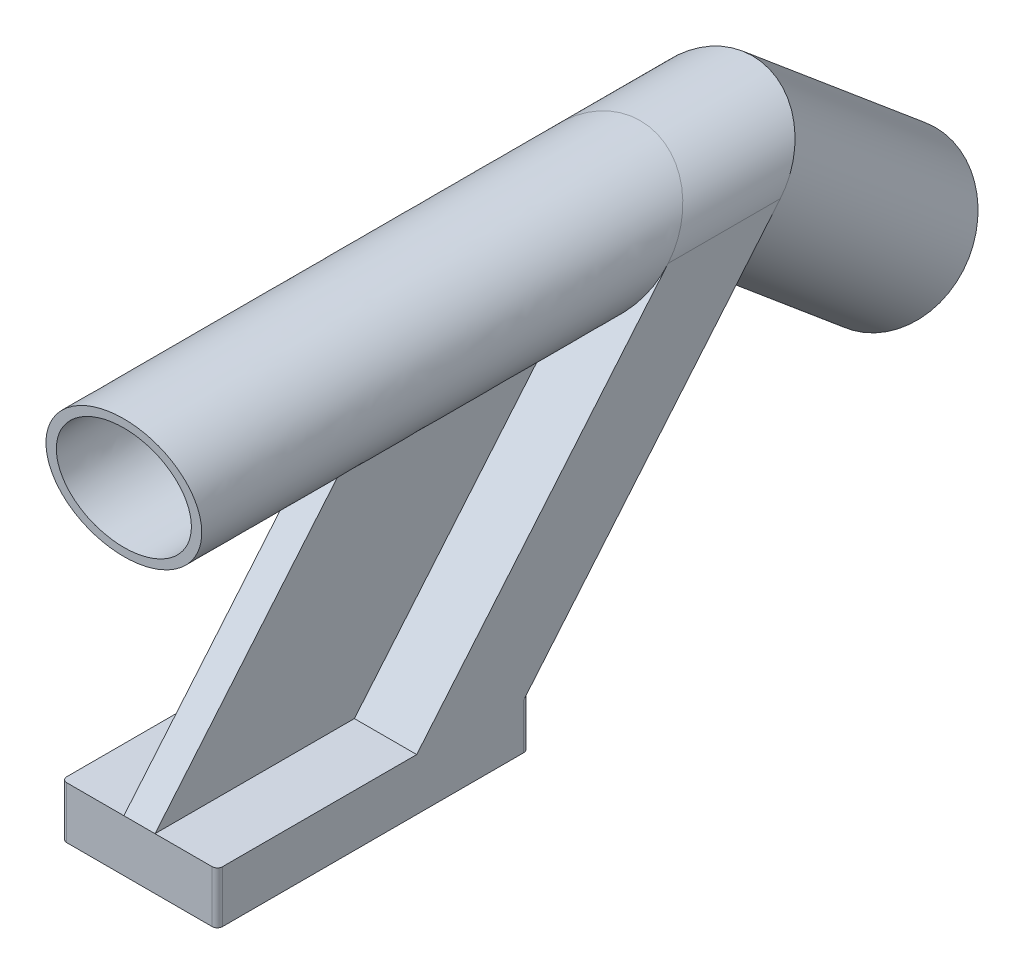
ISO-10303-21;
HEADER;
FILE_DESCRIPTION(('STEP AP214'),'2;1');
FILE_NAME('part.step','',(''),(''),'','','');
FILE_SCHEMA(('AUTOMOTIVE_DESIGN { 1 0 10303 214 1 1 1 1 }'));
ENDSEC;
DATA;
#1=APPLICATION_CONTEXT('core data for automotive mechanical design processes');
#2=APPLICATION_PROTOCOL_DEFINITION('international standard','automotive_design',2000,#1);
#3=PRODUCT_CONTEXT('',#1,'mechanical');
#4=PRODUCT('Part','Part','',(#3));
#5=PRODUCT_RELATED_PRODUCT_CATEGORY('part','',(#4));
#6=PRODUCT_DEFINITION_FORMATION('','',#4);
#7=PRODUCT_DEFINITION_CONTEXT('part definition',#1,'design');
#8=PRODUCT_DEFINITION('design','',#6,#7);
#9=PRODUCT_DEFINITION_SHAPE('','',#8);
#10=(LENGTH_UNIT() NAMED_UNIT(*) SI_UNIT(.MILLI.,.METRE.));
#11=(NAMED_UNIT(*) PLANE_ANGLE_UNIT() SI_UNIT($,.RADIAN.));
#12=(NAMED_UNIT(*) SI_UNIT($,.STERADIAN.) SOLID_ANGLE_UNIT());
#13=UNCERTAINTY_MEASURE_WITH_UNIT(LENGTH_MEASURE(1.E-05),#10,'distance_accuracy_value','');
#14=(GEOMETRIC_REPRESENTATION_CONTEXT(3) GLOBAL_UNCERTAINTY_ASSIGNED_CONTEXT((#13)) GLOBAL_UNIT_ASSIGNED_CONTEXT((#10,
#11,#12)) REPRESENTATION_CONTEXT('',''));
#15=CARTESIAN_POINT('',(0.,0.,0.));
#16=DIRECTION('',(0.,0.,1.));
#17=DIRECTION('',(1.,0.,0.));
#18=AXIS2_PLACEMENT_3D('',#15,#16,#17);
#19=CARTESIAN_POINT('',(0.,338.502844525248,215.962388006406));
#20=DIRECTION('',(0.,0.642787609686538,0.766044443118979));
#21=DIRECTION('',(0.,-0.766044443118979,0.642787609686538));
#22=AXIS2_PLACEMENT_3D('',#19,#20,#21);
#23=CIRCLE('',#22,75.);
#24=DIRECTION('',(0.,0.,-1.));
#25=VECTOR('',#24,1.);
#26=SURFACE_OF_LINEAR_EXTRUSION('',#23,#25);
#27=CARTESIAN_POINT('',(0.,338.502844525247,-284.037611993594));
#28=DIRECTION('',(0.,0.642787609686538,0.766044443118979));
#29=DIRECTION('',(0.,0.766044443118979,-0.642787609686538));
#30=AXIS2_PLACEMENT_3D('',#27,#28,#29);
#31=CIRCLE('',#30,75.);
#32=CARTESIAN_POINT('',(75.,338.502844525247,-284.037611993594));
#33=VERTEX_POINT('',#32);
#34=CARTESIAN_POINT('',(-75.,338.502844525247,-284.037611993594));
#35=VERTEX_POINT('',#34);
#36=EDGE_CURVE('E156',#33,#35,#31,.T.);
#37=ORIENTED_EDGE('',*,*,#36,.T.);
#38=CARTESIAN_POINT('',(0.,338.502844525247,-284.037611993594));
#39=DIRECTION('',(0.,0.642787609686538,0.766044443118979));
#40=DIRECTION('',(0.,-0.766044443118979,0.642787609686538));
#41=AXIS2_PLACEMENT_3D('',#38,#39,#40);
#42=CIRCLE('',#41,75.);
#43=CARTESIAN_POINT('',(-15.,282.210304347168,-236.802562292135));
#44=VERTEX_POINT('',#43);
#45=EDGE_CURVE('E149',#35,#44,#42,.T.);
#46=ORIENTED_EDGE('',*,*,#45,.T.);
#47=DIRECTION('',(0.,0.,-1.));
#48=VECTOR('',#47,1.);
#49=CARTESIAN_POINT('',(-15.,282.210304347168,263.197437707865));
#50=LINE('',#49,#48);
#51=CARTESIAN_POINT('',(-15.,282.210304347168,-44.8475807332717));
#52=VERTEX_POINT('',#51);
#53=EDGE_CURVE('E153',#52,#44,#50,.T.);
#54=ORIENTED_EDGE('',*,*,#53,.F.);
#55=CARTESIAN_POINT('',(-15.,282.210304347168,-44.8475807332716));
#56=CARTESIAN_POINT('',(-14.0982598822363,282.069294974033,-44.7292598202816));
#57=CARTESIAN_POINT('',(-13.1931334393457,281.941012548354,-44.6216180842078));
#58=CARTESIAN_POINT('',(-11.3773106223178,281.710045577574,-44.4278137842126));
#59=CARTESIAN_POINT('',(-10.4666141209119,281.607361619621,-44.3416517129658));
#60=CARTESIAN_POINT('',(-8.64111164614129,281.427763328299,-44.1909508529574));
#61=CARTESIAN_POINT('',(-7.72630669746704,281.350842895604,-44.1264069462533));
#62=CARTESIAN_POINT('',(-5.89368052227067,281.222841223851,-44.0190007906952));
#63=CARTESIAN_POINT('',(-4.97585937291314,281.171759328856,-43.9761379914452));
#64=CARTESIAN_POINT('',(-2.4757861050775,281.068014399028,-43.88908565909));
#65=CARTESIAN_POINT('',(-0.89160533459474,281.040766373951,-43.8662218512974));
#66=CARTESIAN_POINT('',(2.27561874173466,281.063147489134,-43.8850018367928));
#67=CARTESIAN_POINT('',(3.85866209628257,281.11277311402,-43.9266426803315));
#68=CARTESIAN_POINT('',(7.04367020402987,281.290158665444,-44.0754868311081));
#69=CARTESIAN_POINT('',(8.64551670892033,281.41919307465,-44.1837595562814));
#70=CARTESIAN_POINT('',(11.0375041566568,281.671732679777,-44.3956654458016));
#71=CARTESIAN_POINT('',(11.8331279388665,281.765758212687,-44.4745622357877));
#72=CARTESIAN_POINT('',(13.4200125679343,281.973378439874,-44.6487762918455));
#73=CARTESIAN_POINT('',(14.2112734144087,282.086973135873,-44.7440935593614));
#74=CARTESIAN_POINT('',(15.,282.210304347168,-44.8475807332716));
#75=B_SPLINE_CURVE_WITH_KNOTS('',3,(#55,#56,#57,#58,#59,#60,#61,#62,#63,#64,#65,#66,#67,#68,#69,
#70,#71,#72,#73,#74),.UNSPECIFIED.,.F.,.F.,(4,2,2,2,2,2,2,2,2,4),(0.,2.76084314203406,
5.52174960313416,8.28200197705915,11.0421842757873,15.7924790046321,20.5425565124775,
25.370934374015,27.7856837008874,30.2004332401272),.UNSPECIFIED.);
#76=CARTESIAN_POINT('',(15.,282.210304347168,-44.8475807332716));
#77=VERTEX_POINT('',#76);
#78=EDGE_CURVE('E186',#52,#77,#75,.T.);
#79=ORIENTED_EDGE('',*,*,#78,.T.);
#80=DIRECTION('',(0.,0.,-1.));
#81=VECTOR('',#80,1.);
#82=CARTESIAN_POINT('',(15.,282.210304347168,263.197437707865));
#83=LINE('',#82,#81);
#84=CARTESIAN_POINT('',(15.,282.210304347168,-236.802562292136));
#85=VERTEX_POINT('',#84);
#86=EDGE_CURVE('E184',#77,#85,#83,.T.);
#87=ORIENTED_EDGE('',*,*,#86,.T.);
#88=EDGE_CURVE('E161',#85,#33,#42,.T.);
#89=ORIENTED_EDGE('',*,*,#88,.T.);
#90=EDGE_LOOP('',(#37,#46,#54,#79,#87,#89));
#91=FACE_BOUND('',#90,.T.);
#92=CARTESIAN_POINT('',(0.,281.049511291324,165.));
#93=CARTESIAN_POINT('',(2.66369961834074,281.049503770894,165.));
#94=CARTESIAN_POINT('',(5.32727945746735,281.158140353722,165.));
#95=CARTESIAN_POINT('',(10.6376405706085,281.593563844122,165.));
#96=CARTESIAN_POINT('',(13.2844158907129,281.920424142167,165.));
#97=CARTESIAN_POINT('',(18.4183866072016,282.774297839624,165.));
#98=CARTESIAN_POINT('',(20.9072573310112,283.291238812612,165.));
#99=CARTESIAN_POINT('',(25.8336466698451,284.528827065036,165.));
#100=CARTESIAN_POINT('',(28.2711757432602,285.249432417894,165.));
#101=CARTESIAN_POINT('',(32.8406712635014,286.818210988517,165.));
#102=CARTESIAN_POINT('',(34.9792596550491,287.647098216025,165.));
#103=CARTESIAN_POINT('',(39.1813985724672,289.478037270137,165.));
#104=CARTESIAN_POINT('',(41.2449512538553,290.480084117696,165.));
#105=CARTESIAN_POINT('',(45.0371748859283,292.531356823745,165.));
#106=CARTESIAN_POINT('',(46.7765150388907,293.560852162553,165.));
#107=CARTESIAN_POINT('',(50.1642726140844,295.758731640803,165.));
#108=CARTESIAN_POINT('',(51.8127368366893,296.92704329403,165.));
#109=CARTESIAN_POINT('',(54.8031492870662,299.250492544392,165.));
#110=CARTESIAN_POINT('',(56.1577523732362,300.389282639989,165.));
#111=CARTESIAN_POINT('',(58.1167366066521,302.178446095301,165.));
#112=CARTESIAN_POINT('',(58.7579822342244,302.788765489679,165.));
#113=CARTESIAN_POINT('',(60.0140934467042,304.036239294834,165.));
#114=CARTESIAN_POINT('',(60.6289535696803,304.673399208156,165.));
#115=CARTESIAN_POINT('',(62.307287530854,306.490947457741,165.));
#116=CARTESIAN_POINT('',(63.3391667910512,307.700825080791,165.));
#117=CARTESIAN_POINT('',(65.2984733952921,310.203368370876,165.));
#118=CARTESIAN_POINT('',(66.2258703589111,311.496057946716,165.));
#119=CARTESIAN_POINT('',(67.5279112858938,313.492634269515,165.));
#120=CARTESIAN_POINT('',(67.9470963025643,314.167775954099,165.));
#121=CARTESIAN_POINT('',(68.7541509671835,315.536489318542,165.));
#122=CARTESIAN_POINT('',(69.1420242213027,316.230058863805,165.));
#123=CARTESIAN_POINT('',(69.8846950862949,317.634530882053,165.));
#124=CARTESIAN_POINT('',(70.2394990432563,318.345429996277,165.));
#125=CARTESIAN_POINT('',(70.9144175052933,319.783433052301,165.));
#126=CARTESIAN_POINT('',(71.234533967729,320.510536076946,165.));
#127=CARTESIAN_POINT('',(72.0216842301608,322.42531636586,165.));
#128=CARTESIAN_POINT('',(72.4600931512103,323.624911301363,165.));
#129=CARTESIAN_POINT('',(73.2370456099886,326.056027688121,165.));
#130=CARTESIAN_POINT('',(73.5756006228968,327.287545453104,165.));
#131=CARTESIAN_POINT('',(74.004633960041,329.152282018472,165.));
#132=CARTESIAN_POINT('',(74.1344953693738,329.776655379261,165.));
#133=CARTESIAN_POINT('',(74.3675297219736,331.030344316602,165.));
#134=CARTESIAN_POINT('',(74.4707051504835,331.659659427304,165.));
#135=CARTESIAN_POINT('',(74.6499556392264,332.92220272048,165.));
#136=CARTESIAN_POINT('',(74.7260278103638,333.555431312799,165.));
#137=CARTESIAN_POINT('',(74.8507433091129,334.824531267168,165.));
#138=CARTESIAN_POINT('',(74.8993884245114,335.460402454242,165.));
#139=CARTESIAN_POINT('',(74.9807412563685,336.947453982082,165.));
#140=CARTESIAN_POINT('',(75.0026157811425,337.799250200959,165.));
#141=CARTESIAN_POINT('',(74.996885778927,339.502663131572,165.));
#142=CARTESIAN_POINT('',(74.9692804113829,340.354279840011,165.));
#143=CARTESIAN_POINT('',(74.8648025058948,342.054472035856,165.));
#144=CARTESIAN_POINT('',(74.7879309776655,342.90304758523,165.));
#145=CARTESIAN_POINT('',(74.5854786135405,344.594500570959,165.));
#146=CARTESIAN_POINT('',(74.4598895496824,345.437377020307,165.));
#147=CARTESIAN_POINT('',(74.160912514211,347.114620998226,165.));
#148=CARTESIAN_POINT('',(73.9875239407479,347.948988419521,165.));
#149=CARTESIAN_POINT('',(73.5942049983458,349.606594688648,165.));
#150=CARTESIAN_POINT('',(73.3742759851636,350.42983385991,165.));
#151=CARTESIAN_POINT('',(72.7756579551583,352.445690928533,165.));
#152=CARTESIAN_POINT('',(72.370865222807,353.630645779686,165.));
#153=CARTESIAN_POINT('',(71.469623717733,355.964934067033,165.));
#154=CARTESIAN_POINT('',(70.9731765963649,357.114268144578,165.));
#155=CARTESIAN_POINT('',(69.8947187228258,359.372344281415,165.));
#156=CARTESIAN_POINT('',(69.3126869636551,360.481076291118,165.));
#157=CARTESIAN_POINT('',(68.0697689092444,362.653343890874,165.));
#158=CARTESIAN_POINT('',(67.4088789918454,363.716877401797,165.));
#159=CARTESIAN_POINT('',(65.9382700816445,365.909797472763,165.));
#160=CARTESIAN_POINT('',(65.1201768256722,367.033567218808,165.));
#161=CARTESIAN_POINT('',(63.4040266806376,369.218264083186,165.));
#162=CARTESIAN_POINT('',(62.5059617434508,370.279184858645,165.));
#163=CARTESIAN_POINT('',(60.6386466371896,372.335898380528,165.));
#164=CARTESIAN_POINT('',(59.6694092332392,373.331702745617,165.));
#165=CARTESIAN_POINT('',(57.6673392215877,375.257498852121,165.));
#166=CARTESIAN_POINT('',(56.6344941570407,376.187477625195,165.));
#167=CARTESIAN_POINT('',(54.7874400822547,377.748755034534,165.));
#168=CARTESIAN_POINT('',(53.9858387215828,378.395056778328,165.));
#169=CARTESIAN_POINT('',(52.3547297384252,379.651051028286,165.));
#170=CARTESIAN_POINT('',(51.5252267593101,380.260749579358,165.));
#171=CARTESIAN_POINT('',(48.9994097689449,382.034619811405,165.));
#172=CARTESIAN_POINT('',(47.2646215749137,383.144545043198,165.));
#173=CARTESIAN_POINT('',(43.7133811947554,385.219782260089,165.));
#174=CARTESIAN_POINT('',(41.8970041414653,386.185223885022,165.));
#175=CARTESIAN_POINT('',(38.196097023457,387.975605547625,165.));
#176=CARTESIAN_POINT('',(36.3115570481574,388.80052505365,165.));
#177=CARTESIAN_POINT('',(32.4894703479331,390.311786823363,165.));
#178=CARTESIAN_POINT('',(30.5519625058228,390.998227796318,165.));
#179=CARTESIAN_POINT('',(26.634488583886,392.235785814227,165.));
#180=CARTESIAN_POINT('',(24.654525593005,392.786912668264,165.));
#181=CARTESIAN_POINT('',(20.6631995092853,393.755909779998,165.));
#182=CARTESIAN_POINT('',(18.6518498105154,394.173835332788,165.));
#183=CARTESIAN_POINT('',(14.6061850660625,394.878530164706,165.));
#184=CARTESIAN_POINT('',(12.5718669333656,395.165281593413,165.));
#185=CARTESIAN_POINT('',(7.84979393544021,395.678252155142,165.));
#186=CARTESIAN_POINT('',(5.15681215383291,395.857432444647,165.));
#187=CARTESIAN_POINT('',(-0.235072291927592,395.993052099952,165.));
#188=CARTESIAN_POINT('',(-2.93397597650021,395.949449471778,165.));
#189=CARTESIAN_POINT('',(-8.27289558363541,395.641760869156,165.));
#190=CARTESIAN_POINT('',(-10.9131289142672,395.381460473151,165.));
#191=CARTESIAN_POINT('',(-16.1629721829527,394.643396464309,165.));
#192=CARTESIAN_POINT('',(-18.7725851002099,394.165654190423,165.));
#193=CARTESIAN_POINT('',(-23.7542826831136,393.032016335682,165.));
#194=CARTESIAN_POINT('',(-26.1298764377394,392.391539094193,165.));
#195=CARTESIAN_POINT('',(-30.820273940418,390.916943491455,165.));
#196=CARTESIAN_POINT('',(-33.135085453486,390.082850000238,165.));
#197=CARTESIAN_POINT('',(-37.4400875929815,388.316630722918,165.));
#198=CARTESIAN_POINT('',(-39.4385042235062,387.404553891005,165.));
#199=CARTESIAN_POINT('',(-43.3539757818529,385.41919547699,165.));
#200=CARTESIAN_POINT('',(-45.2710349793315,384.345922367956,165.));
#201=CARTESIAN_POINT('',(-48.7757220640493,382.176553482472,165.));
#202=CARTESIAN_POINT('',(-50.3749852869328,381.099261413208,165.));
#203=CARTESIAN_POINT('',(-53.4791369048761,378.817500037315,165.));
#204=CARTESIAN_POINT('',(-54.9840771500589,377.61310159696,165.));
#205=CARTESIAN_POINT('',(-57.7049534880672,375.231975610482,165.));
#206=CARTESIAN_POINT('',(-58.933704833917,374.069946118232,165.));
#207=CARTESIAN_POINT('',(-60.7027920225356,372.25356493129,165.));
#208=CARTESIAN_POINT('',(-61.2805630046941,371.63537867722,165.));
#209=CARTESIAN_POINT('',(-62.4094522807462,370.374858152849,165.));
#210=CARTESIAN_POINT('',(-62.9605654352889,369.732519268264,165.));
#211=CARTESIAN_POINT('',(-64.1434885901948,368.290913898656,165.));
#212=CARTESIAN_POINT('',(-64.7688559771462,367.486343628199,165.));
#213=CARTESIAN_POINT('',(-65.9746779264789,365.843819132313,165.));
#214=CARTESIAN_POINT('',(-66.5551189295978,365.005854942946,165.));
#215=CARTESIAN_POINT('',(-67.6674338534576,363.297972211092,165.));
#216=CARTESIAN_POINT('',(-68.1992969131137,362.428046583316,165.));
#217=CARTESIAN_POINT('',(-69.2099355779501,360.659547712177,165.));
#218=CARTESIAN_POINT('',(-69.6887887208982,359.761018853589,165.));
#219=CARTESIAN_POINT('',(-70.5906516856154,357.936548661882,165.));
#220=CARTESIAN_POINT('',(-71.0136724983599,357.010612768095,165.));
#221=CARTESIAN_POINT('',(-71.8003374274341,355.13438383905,165.));
#222=CARTESIAN_POINT('',(-72.1640156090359,354.184105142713,165.));
#223=CARTESIAN_POINT('',(-72.7316418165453,352.543641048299,165.));
#224=CARTESIAN_POINT('',(-72.9511731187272,351.858807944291,165.));
#225=CARTESIAN_POINT('',(-73.3580557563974,350.479793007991,165.));
#226=CARTESIAN_POINT('',(-73.5454147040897,349.785613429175,165.));
#227=CARTESIAN_POINT('',(-73.8871068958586,348.38913652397,165.));
#228=CARTESIAN_POINT('',(-74.0414386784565,347.686838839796,165.));
#229=CARTESIAN_POINT('',(-74.3163291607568,346.275494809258,165.));
#230=CARTESIAN_POINT('',(-74.4368798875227,345.566446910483,165.));
#231=CARTESIAN_POINT('',(-74.659055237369,344.036464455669,165.));
#232=CARTESIAN_POINT('',(-74.7551202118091,343.214715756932,165.));
#233=CARTESIAN_POINT('',(-74.9010280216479,341.566882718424,165.));
#234=CARTESIAN_POINT('',(-74.9508569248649,340.740797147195,165.));
#235=CARTESIAN_POINT('',(-75.0038942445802,339.087077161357,165.));
#236=CARTESIAN_POINT('',(-75.0070999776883,338.25944266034,165.));
#237=CARTESIAN_POINT('',(-74.9668428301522,336.604541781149,165.));
#238=CARTESIAN_POINT('',(-74.9233363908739,335.777276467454,165.));
#239=CARTESIAN_POINT('',(-74.7898944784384,334.126535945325,165.));
#240=CARTESIAN_POINT('',(-74.6999614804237,333.303060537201,165.));
#241=CARTESIAN_POINT('',(-74.4743224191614,331.6624902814,165.));
#242=CARTESIAN_POINT('',(-74.338618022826,330.845395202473,165.));
#243=CARTESIAN_POINT('',(-73.9431972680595,328.813320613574,165.));
#244=CARTESIAN_POINT('',(-73.6554018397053,327.603701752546,165.));
#245=CARTESIAN_POINT('',(-72.9830318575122,325.211839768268,165.));
#246=CARTESIAN_POINT('',(-72.5984555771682,324.029597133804,165.));
#247=CARTESIAN_POINT('',(-71.7377580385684,321.698792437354,165.));
#248=CARTESIAN_POINT('',(-71.2616244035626,320.550234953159,165.));
#249=CARTESIAN_POINT('',(-70.2238772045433,318.292500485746,165.));
#250=CARTESIAN_POINT('',(-69.662261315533,317.183324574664,165.));
#251=CARTESIAN_POINT('',(-68.4164649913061,314.930083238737,165.));
#252=CARTESIAN_POINT('',(-67.726357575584,313.789297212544,165.));
#253=CARTESIAN_POINT('',(-66.263295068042,311.562196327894,165.));
#254=CARTESIAN_POINT('',(-65.4903331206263,310.475885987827,165.));
#255=CARTESIAN_POINT('',(-63.8696259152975,308.360839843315,165.));
#256=CARTESIAN_POINT('',(-63.0218879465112,307.332098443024,165.));
#257=CARTESIAN_POINT('',(-61.2593663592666,305.334203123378,165.));
#258=CARTESIAN_POINT('',(-60.344590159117,304.365042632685,165.));
#259=CARTESIAN_POINT('',(-58.0292261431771,302.064190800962,165.));
#260=CARTESIAN_POINT('',(-56.5953865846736,300.765798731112,165.));
#261=CARTESIAN_POINT('',(-53.6222978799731,298.298634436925,165.));
#262=CARTESIAN_POINT('',(-52.0831089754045,297.129789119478,165.));
#263=CARTESIAN_POINT('',(-48.9171336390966,294.921084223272,165.));
#264=CARTESIAN_POINT('',(-47.290427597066,293.881109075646,165.));
#265=CARTESIAN_POINT('',(-43.9630181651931,291.927291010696,165.));
#266=CARTESIAN_POINT('',(-42.2623078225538,291.013459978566,165.));
#267=CARTESIAN_POINT('',(-38.8014507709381,289.310661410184,165.));
#268=CARTESIAN_POINT('',(-37.0413558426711,288.521588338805,165.));
#269=CARTESIAN_POINT('',(-33.4714724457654,287.06507865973,165.));
#270=CARTESIAN_POINT('',(-31.6616770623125,286.397659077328,165.));
#271=CARTESIAN_POINT('',(-27.4641969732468,285.003655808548,165.));
#272=CARTESIAN_POINT('',(-25.0630677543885,284.317383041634,165.));
#273=CARTESIAN_POINT('',(-20.2135198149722,283.141190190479,165.));
#274=CARTESIAN_POINT('',(-17.765105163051,282.651253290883,165.));
#275=CARTESIAN_POINT('',(-14.0410659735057,282.056717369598,165.));
#276=CARTESIAN_POINT('',(-12.7764308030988,281.880766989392,165.));
#277=CARTESIAN_POINT('',(-10.2415358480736,281.579218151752,165.));
#278=CARTESIAN_POINT('',(-8.97127774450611,281.453605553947,165.));
#279=CARTESIAN_POINT('',(-5.13826142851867,281.150588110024,165.));
#280=CARTESIAN_POINT('',(-2.56907500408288,281.0495185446,165.));
#281=CARTESIAN_POINT('',(0.,281.049511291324,165.));
#282=B_SPLINE_CURVE_WITH_KNOTS('',3,(#92,#93,#94,#95,#96,#97,#98,#99,#100,#101,#102,#103,#104,
#105,#106,#107,#108,#109,#110,#111,#112,#113,#114,#115,#116,#117,#118,#119,#120,#121,#122,#123,
#124,#125,#126,#127,#128,#129,#130,#131,#132,#133,#134,#135,#136,#137,#138,#139,#140,#141,#142,
#143,#144,#145,#146,#147,#148,#149,#150,#151,#152,#153,#154,#155,#156,#157,#158,#159,#160,#161,
#162,#163,#164,#165,#166,#167,#168,#169,#170,#171,#172,#173,#174,#175,#176,#177,#178,#179,#180,
#181,#182,#183,#184,#185,#186,#187,#188,#189,#190,#191,#192,#193,#194,#195,#196,#197,#198,#199,
#200,#201,#202,#203,#204,#205,#206,#207,#208,#209,#210,#211,#212,#213,#214,#215,#216,#217,#218,
#219,#220,#221,#222,#223,#224,#225,#226,#227,#228,#229,#230,#231,#232,#233,#234,#235,#236,#237,
#238,#239,#240,#241,#242,#243,#244,#245,#246,#247,#248,#249,#250,#251,#252,#253,#254,#255,#256,
#257,#258,#259,#260,#261,#262,#263,#264,#265,#266,#267,#268,#269,#270,#271,#272,#273,#274,#275,
#276,#277,#278,#279,#280,#281),.UNSPECIFIED.,.T.,.F.,(4,2,2,2,2,2,2,2,2,2,2,2,2,2,2,2,2,2,2,2,2,
2,2,2,2,2,2,2,2,2,2,2,2,2,2,2,2,2,2,2,2,2,2,2,2,2,2,2,2,2,2,2,2,2,2,2,2,2,2,2,2,2,2,2,2,2,2,2,2,
2,2,2,2,2,2,2,2,2,2,2,2,2,2,2,2,2,2,2,2,2,2,2,2,2,4),(0.,7.98868024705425,15.9800485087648,
23.5977892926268,31.2139630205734,38.0876203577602,44.9610800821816,51.0183746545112,
57.0725200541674,62.3755766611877,65.0306576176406,67.6862855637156,72.4513065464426,
77.2177095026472,79.6010864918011,81.9841885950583,84.3668324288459,86.749341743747,
90.5766246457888,94.4034675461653,96.316191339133,98.2287369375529,100.141486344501,
102.05411105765,104.608842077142,107.163616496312,109.718338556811,112.273492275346,
114.828678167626,117.383789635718,121.136112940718,124.888368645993,128.641546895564,
132.394897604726,136.560935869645,140.727393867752,144.893106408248,149.059637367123,
152.147694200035,155.235239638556,161.405778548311,167.570747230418,173.736615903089,
179.898073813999,186.059084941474,192.217535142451,198.376823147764,206.46395506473,
214.552611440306,222.502858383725,230.452325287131,237.825742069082,245.198212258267,
251.781562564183,258.364566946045,264.143410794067,269.919049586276,274.986865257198,
277.524674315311,280.062970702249,283.118544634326,286.17503720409,289.232211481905,
292.284853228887,295.336893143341,298.387174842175,300.543938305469,302.700190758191,
304.85653860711,307.013394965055,309.494106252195,311.975564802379,314.457166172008,
316.941083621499,319.424868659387,321.908563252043,325.634277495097,329.360058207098,
333.086342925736,336.812729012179,340.808649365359,344.804900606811,348.800762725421,
352.796183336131,358.590977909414,364.382486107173,370.168762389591,375.955583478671,
381.737482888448,387.52019084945,395.00329404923,402.48575621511,406.315328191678,
410.143823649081,417.848715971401),.UNSPECIFIED.);
#283=CARTESIAN_POINT('',(0.,281.049511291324,165.));
#284=VERTEX_POINT('',#283);
#285=EDGE_CURVE('E409',#284,#284,#282,.T.);
#286=ORIENTED_EDGE('',*,*,#285,.F.);
#287=EDGE_LOOP('',(#286));
#288=FACE_BOUND('',#287,.T.);
#289=ADVANCED_FACE('F35',(#91,#288),#26,.F.);
#290=CARTESIAN_POINT('',(0.,338.502844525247,-604.004617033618));
#291=DIRECTION('',(0.,0.642787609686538,0.766044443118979));
#292=DIRECTION('',(0.,-0.766044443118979,0.642787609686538));
#293=AXIS2_PLACEMENT_3D('',#290,#291,#292);
#294=CIRCLE('',#293,65.);
#295=DIRECTION('',(0.,0.,1.));
#296=VECTOR('',#295,1.);
#297=SURFACE_OF_LINEAR_EXTRUSION('',#294,#296);
#298=CARTESIAN_POINT('',(0.,338.502844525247,-392.08263043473));
#299=DIRECTION('',(0.,-0.642787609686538,-0.766044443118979));
#300=DIRECTION('',(0.,0.766044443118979,-0.642787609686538));
#301=AXIS2_PLACEMENT_3D('',#298,#299,#300);
#302=CIRCLE('',#301,65.);
#303=CARTESIAN_POINT('',(0.,388.295733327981,-433.863825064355));
#304=VERTEX_POINT('',#303);
#305=EDGE_CURVE('E504',#304,#304,#302,.F.);
#306=ORIENTED_EDGE('',*,*,#305,.F.);
#307=EDGE_LOOP('',(#306));
#308=FACE_BOUND('',#307,.T.);
#309=CARTESIAN_POINT('',(0.,288.709955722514,165.));
#310=CARTESIAN_POINT('',(-3.18473076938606,288.709969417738,165.));
#311=CARTESIAN_POINT('',(-6.37152200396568,288.889207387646,165.));
#312=CARTESIAN_POINT('',(-11.118745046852,289.42853424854,165.));
#313=CARTESIAN_POINT('',(-12.6959884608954,289.65346429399,165.));
#314=CARTESIAN_POINT('',(-15.8352442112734,290.19444605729,165.));
#315=CARTESIAN_POINT('',(-17.3972543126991,290.510510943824,165.));
#316=CARTESIAN_POINT('',(-20.9657673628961,291.343589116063,165.));
#317=CARTESIAN_POINT('',(-22.9649229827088,291.892443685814,165.));
#318=CARTESIAN_POINT('',(-26.9130695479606,293.1490249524,165.));
#319=CARTESIAN_POINT('',(-28.8620558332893,293.856766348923,165.));
#320=CARTESIAN_POINT('',(-32.5386432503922,295.370841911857,165.));
#321=CARTESIAN_POINT('',(-34.2714147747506,296.164604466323,165.));
#322=CARTESIAN_POINT('',(-37.6657498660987,297.892073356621,165.));
#323=CARTESIAN_POINT('',(-39.3273272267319,298.825752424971,165.));
#324=CARTESIAN_POINT('',(-42.3605915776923,300.710338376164,165.));
#325=CARTESIAN_POINT('',(-43.7426093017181,301.64461654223,165.));
#326=CARTESIAN_POINT('',(-46.4255327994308,303.623531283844,165.));
#327=CARTESIAN_POINT('',(-47.7264451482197,304.668158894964,165.));
#328=CARTESIAN_POINT('',(-50.0790893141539,306.733834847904,165.));
#329=CARTESIAN_POINT('',(-51.1418795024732,307.74228355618,165.));
#330=CARTESIAN_POINT('',(-53.1807103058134,309.842857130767,165.));
#331=CARTESIAN_POINT('',(-54.1567880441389,310.934945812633,165.));
#332=CARTESIAN_POINT('',(-55.9070191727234,313.075104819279,165.));
#333=CARTESIAN_POINT('',(-56.6915629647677,314.114647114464,165.));
#334=CARTESIAN_POINT('',(-57.8023632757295,315.720095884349,165.));
#335=CARTESIAN_POINT('',(-58.1618044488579,316.263241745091,165.));
#336=CARTESIAN_POINT('',(-58.8574041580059,317.364408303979,165.));
#337=CARTESIAN_POINT('',(-59.1935577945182,317.922432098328,165.));
#338=CARTESIAN_POINT('',(-60.1145319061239,319.529532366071,165.));
#339=CARTESIAN_POINT('',(-60.6698811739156,320.595710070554,165.));
#340=CARTESIAN_POINT('',(-61.6891700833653,322.771445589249,165.));
#341=CARTESIAN_POINT('',(-62.1530855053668,323.881014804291,165.));
#342=CARTESIAN_POINT('',(-62.7748316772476,325.572645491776,165.));
#343=CARTESIAN_POINT('',(-62.9697825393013,326.141277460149,165.));
#344=CARTESIAN_POINT('',(-63.3341319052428,327.286648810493,165.));
#345=CARTESIAN_POINT('',(-63.5035330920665,327.863387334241,165.));
#346=CARTESIAN_POINT('',(-63.8160379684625,329.023944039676,165.));
#347=CARTESIAN_POINT('',(-63.9591417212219,329.607762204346,165.));
#348=CARTESIAN_POINT('',(-64.2183915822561,330.781295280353,165.));
#349=CARTESIAN_POINT('',(-64.3345399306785,331.371009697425,165.));
#350=CARTESIAN_POINT('',(-64.5693968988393,332.728995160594,165.));
#351=CARTESIAN_POINT('',(-64.678856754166,333.498886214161,165.));
#352=CARTESIAN_POINT('',(-64.8508764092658,335.043893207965,165.));
#353=CARTESIAN_POINT('',(-64.9134350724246,335.819009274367,165.));
#354=CARTESIAN_POINT('',(-64.9911355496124,337.371614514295,165.));
#355=CARTESIAN_POINT('',(-65.0062780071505,338.149103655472,165.));
#356=CARTESIAN_POINT('',(-64.9890235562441,339.703253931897,165.));
#357=CARTESIAN_POINT('',(-64.9566446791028,340.47991526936,165.));
#358=CARTESIAN_POINT('',(-64.8446462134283,342.029838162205,165.));
#359=CARTESIAN_POINT('',(-64.7650261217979,342.803099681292,165.));
#360=CARTESIAN_POINT('',(-64.5592257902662,344.3432896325,165.));
#361=CARTESIAN_POINT('',(-64.4330492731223,345.110218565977,165.));
#362=CARTESIAN_POINT('',(-64.0774842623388,346.930126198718,165.));
#363=CARTESIAN_POINT('',(-63.8270521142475,347.979056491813,165.));
#364=CARTESIAN_POINT('',(-63.2422466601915,350.053028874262,165.));
#365=CARTESIAN_POINT('',(-62.9078783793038,351.078072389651,165.));
#366=CARTESIAN_POINT('',(-62.1597181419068,353.098947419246,165.));
#367=CARTESIAN_POINT('',(-61.745909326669,354.094772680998,165.));
#368=CARTESIAN_POINT('',(-60.8441491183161,356.052212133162,165.));
#369=CARTESIAN_POINT('',(-60.3561942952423,357.013824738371,165.));
#370=CARTESIAN_POINT('',(-59.2741800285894,358.966762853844,165.));
#371=CARTESIAN_POINT('',(-58.6750156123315,359.955257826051,165.));
#372=CARTESIAN_POINT('',(-57.4049210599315,361.88496678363,165.));
#373=CARTESIAN_POINT('',(-56.7339853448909,362.826177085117,165.));
#374=CARTESIAN_POINT('',(-55.3273391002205,364.658641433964,165.));
#375=CARTESIAN_POINT('',(-54.5916348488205,365.549900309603,165.));
#376=CARTESIAN_POINT('',(-53.0621592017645,367.28072567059,165.));
#377=CARTESIAN_POINT('',(-52.2683941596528,368.120297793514,165.));
#378=CARTESIAN_POINT('',(-50.2590760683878,370.113781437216,165.));
#379=CARTESIAN_POINT('',(-49.0146929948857,371.238774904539,165.));
#380=CARTESIAN_POINT('',(-46.4346234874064,373.376262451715,165.));
#381=CARTESIAN_POINT('',(-45.0989906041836,374.388821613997,165.));
#382=CARTESIAN_POINT('',(-42.3518804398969,376.302001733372,165.));
#383=CARTESIAN_POINT('',(-40.9404743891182,377.202725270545,165.));
#384=CARTESIAN_POINT('',(-38.0534960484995,378.894790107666,165.));
#385=CARTESIAN_POINT('',(-36.5779141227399,379.686114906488,165.));
#386=CARTESIAN_POINT('',(-33.5751822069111,381.160480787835,165.));
#387=CARTESIAN_POINT('',(-32.0480728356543,381.843604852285,165.));
#388=CARTESIAN_POINT('',(-28.9511142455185,383.104183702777,165.));
#389=CARTESIAN_POINT('',(-27.3812682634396,383.681646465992,165.));
#390=CARTESIAN_POINT('',(-24.2080576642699,384.732571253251,165.));
#391=CARTESIAN_POINT('',(-22.6047096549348,385.206083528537,165.));
#392=CARTESIAN_POINT('',(-19.3712776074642,386.051145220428,165.));
#393=CARTESIAN_POINT('',(-17.741189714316,386.42267979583,165.));
#394=CARTESIAN_POINT('',(-13.8181919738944,387.191041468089,165.));
#395=CARTESIAN_POINT('',(-11.5159096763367,387.54070561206,165.));
#396=CARTESIAN_POINT('',(-6.88997205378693,388.047562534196,165.));
#397=CARTESIAN_POINT('',(-4.56631156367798,388.204707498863,165.));
#398=CARTESIAN_POINT('',(0.0855475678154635,388.327587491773,165.));
#399=CARTESIAN_POINT('',(2.41374503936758,388.293366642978,165.));
#400=CARTESIAN_POINT('',(7.05929721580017,388.033349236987,165.));
#401=CARTESIAN_POINT('',(9.37665279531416,387.807568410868,165.));
#402=CARTESIAN_POINT('',(13.8868984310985,387.176423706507,165.));
#403=CARTESIAN_POINT('',(16.0809075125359,386.779058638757,165.));
#404=CARTESIAN_POINT('',(20.4287324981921,385.804440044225,165.));
#405=CARTESIAN_POINT('',(22.5825511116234,385.227198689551,165.));
#406=CARTESIAN_POINT('',(26.6367049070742,383.950890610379,165.));
#407=CARTESIAN_POINT('',(28.5421151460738,383.267942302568,165.));
#408=CARTESIAN_POINT('',(32.2903534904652,381.747588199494,165.));
#409=CARTESIAN_POINT('',(34.1331914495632,380.910206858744,165.));
#410=CARTESIAN_POINT('',(37.5282456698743,379.184654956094,165.));
#411=CARTESIAN_POINT('',(39.0892751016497,378.313824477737,165.));
#412=CARTESIAN_POINT('',(42.1348228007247,376.446869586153,165.));
#413=CARTESIAN_POINT('',(43.619346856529,375.450754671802,165.));
#414=CARTESIAN_POINT('',(46.3172951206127,373.46305477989,165.));
#415=CARTESIAN_POINT('',(47.5415363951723,372.486157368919,165.));
#416=CARTESIAN_POINT('',(49.9053516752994,370.435437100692,165.));
#417=CARTESIAN_POINT('',(51.044964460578,369.361659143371,165.));
#418=CARTESIAN_POINT('',(53.0970623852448,367.250384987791,165.));
#419=CARTESIAN_POINT('',(54.0204814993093,366.223554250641,165.));
#420=CARTESIAN_POINT('',(55.3402297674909,364.628615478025,165.));
#421=CARTESIAN_POINT('',(55.7694769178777,364.087527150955,165.));
#422=CARTESIAN_POINT('',(56.604704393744,362.987493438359,165.));
#423=CARTESIAN_POINT('',(57.0106797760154,362.428544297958,165.));
#424=CARTESIAN_POINT('',(58.1212458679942,360.826911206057,165.));
#425=CARTESIAN_POINT('',(58.7971350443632,359.764095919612,165.));
#426=CARTESIAN_POINT('',(60.0575758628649,357.584999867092,165.));
#427=CARTESIAN_POINT('',(60.6421039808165,356.468705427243,165.));
#428=CARTESIAN_POINT('',(61.4435023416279,354.758917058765,165.));
#429=CARTESIAN_POINT('',(61.6981419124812,354.182898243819,165.));
#430=CARTESIAN_POINT('',(62.1812001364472,353.019992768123,165.));
#431=CARTESIAN_POINT('',(62.4096216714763,352.433107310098,165.));
#432=CARTESIAN_POINT('',(62.8392360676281,351.249452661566,165.));
#433=CARTESIAN_POINT('',(63.0404289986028,350.652683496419,165.));
#434=CARTESIAN_POINT('',(63.4146362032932,349.450439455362,165.));
#435=CARTESIAN_POINT('',(63.5876529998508,348.844965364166,165.));
#436=CARTESIAN_POINT('',(63.9500668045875,347.452025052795,165.));
#437=CARTESIAN_POINT('',(64.1299794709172,346.662068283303,165.));
#438=CARTESIAN_POINT('',(64.4402981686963,345.072480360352,165.));
#439=CARTESIAN_POINT('',(64.5707030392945,344.272848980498,165.));
#440=CARTESIAN_POINT('',(64.7808704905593,342.666945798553,165.));
#441=CARTESIAN_POINT('',(64.8606334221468,341.860674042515,165.));
#442=CARTESIAN_POINT('',(64.9687691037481,340.245182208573,165.));
#443=CARTESIAN_POINT('',(64.9971730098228,339.435964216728,165.));
#444=CARTESIAN_POINT('',(65.0024251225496,337.817342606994,165.));
#445=CARTESIAN_POINT('',(64.9792728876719,337.007938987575,165.));
#446=CARTESIAN_POINT('',(64.8816420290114,335.392377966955,165.));
#447=CARTESIAN_POINT('',(64.8071696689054,334.586220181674,165.));
#448=CARTESIAN_POINT('',(64.573876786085,332.709415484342,165.));
#449=CARTESIAN_POINT('',(64.3950881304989,331.641194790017,165.));
#450=CARTESIAN_POINT('',(63.9496765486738,329.523454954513,165.));
#451=CARTESIAN_POINT('',(63.6830612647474,328.473934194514,165.));
#452=CARTESIAN_POINT('',(63.0658661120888,326.399705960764,165.));
#453=CARTESIAN_POINT('',(62.7152700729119,325.375003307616,165.));
#454=CARTESIAN_POINT('',(61.934944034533,323.356234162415,165.));
#455=CARTESIAN_POINT('',(61.5052106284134,322.362168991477,165.));
#456=CARTESIAN_POINT('',(60.552345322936,320.368220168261,165.));
#457=CARTESIAN_POINT('',(60.0260426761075,319.369853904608,165.));
#458=CARTESIAN_POINT('',(58.8997949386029,317.415619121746,165.));
#459=CARTESIAN_POINT('',(58.2998456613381,316.459753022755,165.));
#460=CARTESIAN_POINT('',(57.0330285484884,314.59394342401,165.));
#461=CARTESIAN_POINT('',(56.3661803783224,313.683986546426,165.));
#462=CARTESIAN_POINT('',(54.9719395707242,311.912055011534,165.));
#463=CARTESIAN_POINT('',(54.2445531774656,311.050075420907,165.));
#464=CARTESIAN_POINT('',(52.4165610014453,309.021860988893,165.));
#465=CARTESIAN_POINT('',(51.287984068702,307.880720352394,165.));
#466=CARTESIAN_POINT('',(48.9370009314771,305.700594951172,165.));
#467=CARTESIAN_POINT('',(47.714606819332,304.661597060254,165.));
#468=CARTESIAN_POINT('',(45.1785463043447,302.676730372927,165.));
#469=CARTESIAN_POINT('',(43.8641479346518,301.731799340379,165.));
#470=CARTESIAN_POINT('',(41.1665540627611,299.944880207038,165.));
#471=CARTESIAN_POINT('',(39.7833282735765,299.102937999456,165.));
#472=CARTESIAN_POINT('',(36.9583536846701,297.520213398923,165.));
#473=CARTESIAN_POINT('',(35.5165430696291,296.779541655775,165.));
#474=CARTESIAN_POINT('',(32.5861245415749,295.398954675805,165.));
#475=CARTESIAN_POINT('',(31.0975296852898,294.75901162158,165.));
#476=CARTESIAN_POINT('',(27.868249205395,293.494240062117,165.));
#477=CARTESIAN_POINT('',(26.1217023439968,292.884368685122,165.));
#478=CARTESIAN_POINT('',(22.5916266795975,291.791475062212,165.));
#479=CARTESIAN_POINT('',(20.8081409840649,291.308313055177,165.));
#480=CARTESIAN_POINT('',(17.4648152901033,290.525022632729,165.));
#481=CARTESIAN_POINT('',(15.9087330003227,290.208720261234,165.));
#482=CARTESIAN_POINT('',(12.7806242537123,289.666518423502,165.));
#483=CARTESIAN_POINT('',(11.2085949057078,289.440635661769,165.));
#484=CARTESIAN_POINT('',(8.03311176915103,289.076172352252,165.));
#485=CARTESIAN_POINT('',(6.42951876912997,288.938798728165,165.));
#486=CARTESIAN_POINT('',(3.21745904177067,288.755688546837,165.));
#487=CARTESIAN_POINT('',(1.60899248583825,288.709948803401,165.));
#488=CARTESIAN_POINT('',(0.,288.709955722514,165.));
#489=B_SPLINE_CURVE_WITH_KNOTS('',3,(#309,#310,#311,#312,#313,#314,#315,#316,#317,#318,#319,
#320,#321,#322,#323,#324,#325,#326,#327,#328,#329,#330,#331,#332,#333,#334,#335,#336,#337,#338,
#339,#340,#341,#342,#343,#344,#345,#346,#347,#348,#349,#350,#351,#352,#353,#354,#355,#356,#357,
#358,#359,#360,#361,#362,#363,#364,#365,#366,#367,#368,#369,#370,#371,#372,#373,#374,#375,#376,
#377,#378,#379,#380,#381,#382,#383,#384,#385,#386,#387,#388,#389,#390,#391,#392,#393,#394,#395,
#396,#397,#398,#399,#400,#401,#402,#403,#404,#405,#406,#407,#408,#409,#410,#411,#412,#413,#414,
#415,#416,#417,#418,#419,#420,#421,#422,#423,#424,#425,#426,#427,#428,#429,#430,#431,#432,#433,
#434,#435,#436,#437,#438,#439,#440,#441,#442,#443,#444,#445,#446,#447,#448,#449,#450,#451,#452,
#453,#454,#455,#456,#457,#458,#459,#460,#461,#462,#463,#464,#465,#466,#467,#468,#469,#470,#471,
#472,#473,#474,#475,#476,#477,#478,#479,#480,#481,#482,#483,#484,#485,#486,#487,#488),
.UNSPECIFIED.,.T.,.F.,(4,2,2,2,2,2,2,2,2,2,2,2,2,2,2,2,2,2,2,2,2,2,2,2,2,2,2,2,2,2,2,2,2,2,2,2,
2,2,2,2,2,2,2,2,2,2,2,2,2,2,2,2,2,2,2,2,2,2,2,2,2,2,2,2,2,2,2,2,2,2,2,2,2,2,2,2,2,2,2,2,2,2,2,2,
2,2,2,2,2,4),(0.,9.5510983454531,14.3286664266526,19.1069251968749,25.3197689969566,
31.5331878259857,37.2450081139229,42.9557167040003,47.9551769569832,52.9542313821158,
57.3449579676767,61.7337956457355,65.6363925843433,67.5898106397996,69.5436384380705,
73.145832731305,76.7489799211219,78.551847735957,80.3545261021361,82.1572001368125,
83.9597243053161,86.2911498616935,88.6226319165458,90.954082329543,93.2846483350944,
95.6152391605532,97.9456436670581,101.177061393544,104.408285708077,107.64019650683,
110.872256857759,114.33657529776,117.801163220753,121.265415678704,124.729289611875,
129.754708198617,134.777202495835,139.795055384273,144.813664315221,149.828405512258,
154.842767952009,159.854701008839,164.867363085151,171.844727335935,178.823824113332,
185.80131179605,192.77822653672,199.460071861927,206.141465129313,212.207446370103,
218.272467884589,223.629485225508,228.98609665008,233.679969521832,238.371678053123,
242.509863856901,244.581338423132,246.653251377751,250.427446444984,254.202611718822,
256.091456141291,257.980092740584,259.868724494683,261.757187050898,264.186138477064,
266.615146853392,269.044138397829,271.471655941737,273.899194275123,276.326436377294,
279.571698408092,282.81667812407,286.062283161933,289.308027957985,292.690437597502,
296.073039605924,299.454650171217,302.835912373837,307.643948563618,312.451366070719,
317.302713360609,322.156214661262,327.014977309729,331.872395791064,337.41727066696,
342.956003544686,347.717074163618,352.479023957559,357.304606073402,362.130020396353),.UNSPECIFIED.);
#490=CARTESIAN_POINT('',(0.,288.709955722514,165.));
#491=VERTEX_POINT('',#490);
#492=EDGE_CURVE('E39',#491,#491,#489,.T.);
#493=ORIENTED_EDGE('',*,*,#492,.F.);
#494=EDGE_LOOP('',(#493));
#495=FACE_BOUND('',#494,.T.);
#496=ADVANCED_FACE('F219',(#308,#495),#297,.F.);
#497=CARTESIAN_POINT('',(0.,50.,0.));
#498=DIRECTION('',(0.,1.,0.));
#499=DIRECTION('',(0.,0.,1.));
#500=AXIS2_PLACEMENT_3D('',#497,#498,#499);
#501=PLANE('',#500);
#502=DIRECTION('',(0.,0.,1.));
#503=VECTOR('',#502,1.);
#504=CARTESIAN_POINT('',(-75.,50.,-150.));
#505=LINE('',#504,#503);
#506=CARTESIAN_POINT('',(-75.,50.,-41.9549815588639));
#507=VERTEX_POINT('',#506);
#508=CARTESIAN_POINT('',(-75.,50.,145.));
#509=VERTEX_POINT('',#508);
#510=EDGE_CURVE('E450',#507,#509,#505,.T.);
#511=ORIENTED_EDGE('',*,*,#510,.T.);
#512=CARTESIAN_POINT('',(-70.,50.,145.));
#513=DIRECTION('',(0.,1.,0.));
#514=DIRECTION('',(0.,0.,1.));
#515=AXIS2_PLACEMENT_3D('',#512,#513,#514);
#516=CIRCLE('',#515,5.);
#517=CARTESIAN_POINT('',(-70.,50.,150.));
#518=VERTEX_POINT('',#517);
#519=EDGE_CURVE('E470',#509,#518,#516,.T.);
#520=ORIENTED_EDGE('',*,*,#519,.T.);
#521=DIRECTION('',(1.,0.,0.));
#522=VECTOR('',#521,1.);
#523=CARTESIAN_POINT('',(-75.,50.,150.));
#524=LINE('',#523,#522);
#525=CARTESIAN_POINT('',(-15.,50.,150.));
#526=VERTEX_POINT('',#525);
#527=EDGE_CURVE('E420',#518,#526,#524,.T.);
#528=ORIENTED_EDGE('',*,*,#527,.T.);
#529=DIRECTION('',(0.,0.,-1.));
#530=VECTOR('',#529,1.);
#531=CARTESIAN_POINT('',(-15.,50.,0.));
#532=LINE('',#531,#530);
#533=CARTESIAN_POINT('',(-15.,50.,-41.9549815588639));
#534=VERTEX_POINT('',#533);
#535=EDGE_CURVE('E170',#526,#534,#532,.T.);
#536=ORIENTED_EDGE('',*,*,#535,.T.);
#537=DIRECTION('',(-1.,0.,0.));
#538=VECTOR('',#537,1.);
#539=CARTESIAN_POINT('',(0.,50.,-41.9549815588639));
#540=LINE('',#539,#538);
#541=EDGE_CURVE('E167',#534,#507,#540,.T.);
#542=ORIENTED_EDGE('',*,*,#541,.T.);
#543=EDGE_LOOP('',(#511,#520,#528,#536,#542));
#544=FACE_BOUND('',#543,.T.);
#545=ADVANCED_FACE('F223',(#544),#501,.T.);
#546=CARTESIAN_POINT('',(0.,338.502844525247,-284.037611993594));
#547=DIRECTION('',(0.,-0.642787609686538,-0.766044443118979));
#548=DIRECTION('',(0.,0.766044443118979,-0.642787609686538));
#549=AXIS2_PLACEMENT_3D('',#546,#547,#548);
#550=PLANE('',#549);
#551=DIRECTION('',(0.,-0.766044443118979,0.642787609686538));
#552=VECTOR('',#551,1.);
#553=CARTESIAN_POINT('',(-15.,338.502844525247,-284.037611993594));
#554=LINE('',#553,#552);
#555=EDGE_CURVE('E165',#44,#534,#554,.T.);
#556=ORIENTED_EDGE('',*,*,#555,.F.);
#557=ORIENTED_EDGE('',*,*,#45,.F.);
#558=DIRECTION('',(0.,-0.766044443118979,0.642787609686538));
#559=VECTOR('',#558,1.);
#560=CARTESIAN_POINT('',(-75.,0.,0.));
#561=LINE('',#560,#559);
#562=EDGE_CURVE('E233',#35,#507,#561,.T.);
#563=ORIENTED_EDGE('',*,*,#562,.T.);
#564=ORIENTED_EDGE('',*,*,#541,.F.);
#565=EDGE_LOOP('',(#556,#557,#563,#564));
#566=FACE_BOUND('',#565,.T.);
#567=ADVANCED_FACE('F166',(#566),#550,.F.);
#568=CARTESIAN_POINT('',(0.,338.502844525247,-392.08263043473));
#569=DIRECTION('',(0.,-0.642787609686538,-0.766044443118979));
#570=DIRECTION('',(0.,0.766044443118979,-0.642787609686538));
#571=AXIS2_PLACEMENT_3D('',#568,#569,#570);
#572=PLANE('',#571);
#573=DIRECTION('',(0.,0.766044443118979,-0.642787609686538));
#574=VECTOR('',#573,1.);
#575=CARTESIAN_POINT('',(75.,338.502844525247,-392.08263043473));
#576=LINE('',#575,#574);
#577=CARTESIAN_POINT('',(75.,44.0412320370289,-145.));
#578=VERTEX_POINT('',#577);
#579=CARTESIAN_POINT('',(75.,338.502844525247,-392.08263043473));
#580=VERTEX_POINT('',#579);
#581=EDGE_CURVE('E55',#578,#580,#576,.T.);
#582=ORIENTED_EDGE('',*,*,#581,.F.);
#583=CARTESIAN_POINT('',(70.,44.0412320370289,-145.));
#584=DIRECTION('',(0.,-0.642787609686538,-0.766044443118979));
#585=DIRECTION('',(0.,-0.766044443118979,0.642787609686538));
#586=AXIS2_PLACEMENT_3D('',#583,#584,#585);
#587=ELLIPSE('',#586,7.77861913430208,5.);
#588=CARTESIAN_POINT('',(70.,50.,-150.));
#589=VERTEX_POINT('',#588);
#590=EDGE_CURVE('E11',#578,#589,#587,.F.);
#591=ORIENTED_EDGE('',*,*,#590,.T.);
#592=DIRECTION('',(-1.,0.,0.));
#593=VECTOR('',#592,1.);
#594=CARTESIAN_POINT('',(-75.,50.,-150.));
#595=LINE('',#594,#593);
#596=CARTESIAN_POINT('',(-70.,50.,-150.));
#597=VERTEX_POINT('',#596);
#598=EDGE_CURVE('E447',#589,#597,#595,.T.);
#599=ORIENTED_EDGE('',*,*,#598,.T.);
#600=CARTESIAN_POINT('',(-70.,44.0412320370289,-145.));
#601=DIRECTION('',(0.,-0.642787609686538,-0.766044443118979));
#602=DIRECTION('',(0.,-0.766044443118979,0.642787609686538));
#603=AXIS2_PLACEMENT_3D('',#600,#601,#602);
#604=ELLIPSE('',#603,7.77861913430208,5.);
#605=CARTESIAN_POINT('',(-75.,44.0412320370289,-145.));
#606=VERTEX_POINT('',#605);
#607=EDGE_CURVE('E49',#597,#606,#604,.F.);
#608=ORIENTED_EDGE('',*,*,#607,.T.);
#609=DIRECTION('',(0.,-0.766044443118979,0.642787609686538));
#610=VECTOR('',#609,1.);
#611=CARTESIAN_POINT('',(-75.,0.,-108.045018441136));
#612=LINE('',#611,#610);
#613=CARTESIAN_POINT('',(-75.,338.502844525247,-392.08263043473));
#614=VERTEX_POINT('',#613);
#615=EDGE_CURVE('E236',#614,#606,#612,.T.);
#616=ORIENTED_EDGE('',*,*,#615,.F.);
#617=CARTESIAN_POINT('',(0.,338.502844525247,-392.08263043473));
#618=DIRECTION('',(0.,-0.642787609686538,-0.766044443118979));
#619=DIRECTION('',(0.,0.766044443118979,-0.642787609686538));
#620=AXIS2_PLACEMENT_3D('',#617,#618,#619);
#621=CIRCLE('',#620,75.);
#622=EDGE_CURVE('E227',#580,#614,#621,.T.);
#623=ORIENTED_EDGE('',*,*,#622,.F.);
#624=EDGE_LOOP('',(#582,#591,#599,#608,#616,#623));
#625=FACE_BOUND('',#624,.T.);
#626=ADVANCED_FACE('F249',(#625),#572,.T.);
#627=CARTESIAN_POINT('',(15.,50.,150.));
#628=VERTEX_POINT('',#627);
#629=CARTESIAN_POINT('',(70.,50.,150.));
#630=VERTEX_POINT('',#629);
#631=EDGE_CURVE('E452',#628,#630,#524,.T.);
#632=ORIENTED_EDGE('',*,*,#631,.T.);
#633=CARTESIAN_POINT('',(70.,50.,145.));
#634=DIRECTION('',(0.,1.,0.));
#635=DIRECTION('',(0.,0.,1.));
#636=AXIS2_PLACEMENT_3D('',#633,#634,#635);
#637=CIRCLE('',#636,5.);
#638=CARTESIAN_POINT('',(75.,50.,145.));
#639=VERTEX_POINT('',#638);
#640=EDGE_CURVE('E475',#630,#639,#637,.T.);
#641=ORIENTED_EDGE('',*,*,#640,.T.);
#642=DIRECTION('',(0.,0.,-1.));
#643=VECTOR('',#642,1.);
#644=CARTESIAN_POINT('',(75.,50.,-150.));
#645=LINE('',#644,#643);
#646=CARTESIAN_POINT('',(75.,49.9999999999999,-41.9549815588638));
#647=VERTEX_POINT('',#646);
#648=EDGE_CURVE('E435',#639,#647,#645,.T.);
#649=ORIENTED_EDGE('',*,*,#648,.T.);
#650=CARTESIAN_POINT('',(15.,50.,-41.9549815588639));
#651=VERTEX_POINT('',#650);
#652=EDGE_CURVE('E430',#647,#651,#540,.T.);
#653=ORIENTED_EDGE('',*,*,#652,.T.);
#654=DIRECTION('',(0.,0.,-1.));
#655=VECTOR('',#654,1.);
#656=CARTESIAN_POINT('',(15.,50.,0.));
#657=LINE('',#656,#655);
#658=EDGE_CURVE('E176',#628,#651,#657,.T.);
#659=ORIENTED_EDGE('',*,*,#658,.F.);
#660=EDGE_LOOP('',(#632,#641,#649,#653,#659));
#661=FACE_BOUND('',#660,.T.);
#662=ADVANCED_FACE('F245',(#661),#501,.T.);
#663=CARTESIAN_POINT('',(75.,50.,-150.));
#664=DIRECTION('',(-1.,0.,0.));
#665=DIRECTION('',(0.,0.,1.));
#666=AXIS2_PLACEMENT_3D('',#663,#664,#665);
#667=PLANE('',#666);
#668=DIRECTION('',(0.,0.,-1.));
#669=VECTOR('',#668,1.);
#670=CARTESIAN_POINT('',(75.,0.,-150.));
#671=LINE('',#670,#669);
#672=CARTESIAN_POINT('',(75.,0.,145.));
#673=VERTEX_POINT('',#672);
#674=CARTESIAN_POINT('',(75.,0.,-145.));
#675=VERTEX_POINT('',#674);
#676=EDGE_CURVE('E436',#673,#675,#671,.T.);
#677=ORIENTED_EDGE('',*,*,#676,.T.);
#678=DIRECTION('',(0.,-1.,0.));
#679=VECTOR('',#678,1.);
#680=CARTESIAN_POINT('',(75.,50.,-145.));
#681=LINE('',#680,#679);
#682=EDGE_CURVE('E488',#675,#578,#681,.F.);
#683=ORIENTED_EDGE('',*,*,#682,.T.);
#684=ORIENTED_EDGE('',*,*,#581,.T.);
#685=DIRECTION('',(0.,0.,1.));
#686=VECTOR('',#685,1.);
#687=CARTESIAN_POINT('',(75.,338.502844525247,-392.08263043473));
#688=LINE('',#687,#686);
#689=EDGE_CURVE('E444',#580,#33,#688,.T.);
#690=ORIENTED_EDGE('',*,*,#689,.T.);
#691=DIRECTION('',(0.,0.766044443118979,-0.642787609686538));
#692=VECTOR('',#691,1.);
#693=CARTESIAN_POINT('',(75.,338.502844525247,-284.037611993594));
#694=LINE('',#693,#692);
#695=EDGE_CURVE('E511',#647,#33,#694,.T.);
#696=ORIENTED_EDGE('',*,*,#695,.F.);
#697=ORIENTED_EDGE('',*,*,#648,.F.);
#698=DIRECTION('',(0.,-1.,0.));
#699=VECTOR('',#698,1.);
#700=CARTESIAN_POINT('',(75.,50.,145.));
#701=LINE('',#700,#699);
#702=EDGE_CURVE('E472',#639,#673,#701,.T.);
#703=ORIENTED_EDGE('',*,*,#702,.T.);
#704=EDGE_LOOP('',(#677,#683,#684,#690,#696,#697,#703));
#705=FACE_BOUND('',#704,.T.);
#706=ADVANCED_FACE('F248',(#705),#667,.F.);
#707=CARTESIAN_POINT('',(-75.,50.,-150.));
#708=DIRECTION('',(0.,0.,1.));
#709=DIRECTION('',(1.,0.,0.));
#710=AXIS2_PLACEMENT_3D('',#707,#708,#709);
#711=PLANE('',#710);
#712=DIRECTION('',(-1.,0.,0.));
#713=VECTOR('',#712,1.);
#714=CARTESIAN_POINT('',(-75.,0.,-150.));
#715=LINE('',#714,#713);
#716=CARTESIAN_POINT('',(70.,0.,-150.));
#717=VERTEX_POINT('',#716);
#718=CARTESIAN_POINT('',(-70.,0.,-150.));
#719=VERTEX_POINT('',#718);
#720=EDGE_CURVE('E439',#717,#719,#715,.T.);
#721=ORIENTED_EDGE('',*,*,#720,.T.);
#722=DIRECTION('',(0.,-1.,0.));
#723=VECTOR('',#722,1.);
#724=CARTESIAN_POINT('',(-70.,50.,-150.));
#725=LINE('',#724,#723);
#726=EDGE_CURVE('E63',#719,#597,#725,.F.);
#727=ORIENTED_EDGE('',*,*,#726,.T.);
#728=ORIENTED_EDGE('',*,*,#598,.F.);
#729=DIRECTION('',(0.,-1.,0.));
#730=VECTOR('',#729,1.);
#731=CARTESIAN_POINT('',(70.,50.,-150.));
#732=LINE('',#731,#730);
#733=EDGE_CURVE('E484',#589,#717,#732,.T.);
#734=ORIENTED_EDGE('',*,*,#733,.T.);
#735=EDGE_LOOP('',(#721,#727,#728,#734));
#736=FACE_BOUND('',#735,.T.);
#737=ADVANCED_FACE('F261',(#736),#711,.F.);
#738=CARTESIAN_POINT('',(-75.,50.,-150.));
#739=DIRECTION('',(1.,0.,0.));
#740=DIRECTION('',(0.,0.,-1.));
#741=AXIS2_PLACEMENT_3D('',#738,#739,#740);
#742=PLANE('',#741);
#743=ORIENTED_EDGE('',*,*,#615,.T.);
#744=DIRECTION('',(0.,-1.,0.));
#745=VECTOR('',#744,1.);
#746=CARTESIAN_POINT('',(-75.,50.,-145.));
#747=LINE('',#746,#745);
#748=CARTESIAN_POINT('',(-75.,0.,-145.));
#749=VERTEX_POINT('',#748);
#750=EDGE_CURVE('E477',#606,#749,#747,.T.);
#751=ORIENTED_EDGE('',*,*,#750,.T.);
#752=DIRECTION('',(0.,0.,1.));
#753=VECTOR('',#752,1.);
#754=CARTESIAN_POINT('',(-75.,0.,-150.));
#755=LINE('',#754,#753);
#756=CARTESIAN_POINT('',(-75.,0.,145.));
#757=VERTEX_POINT('',#756);
#758=EDGE_CURVE('E455',#749,#757,#755,.T.);
#759=ORIENTED_EDGE('',*,*,#758,.T.);
#760=DIRECTION('',(0.,-1.,0.));
#761=VECTOR('',#760,1.);
#762=CARTESIAN_POINT('',(-75.,50.,145.));
#763=LINE('',#762,#761);
#764=EDGE_CURVE('E468',#757,#509,#763,.F.);
#765=ORIENTED_EDGE('',*,*,#764,.T.);
#766=ORIENTED_EDGE('',*,*,#510,.F.);
#767=ORIENTED_EDGE('',*,*,#562,.F.);
#768=DIRECTION('',(0.,0.,1.));
#769=VECTOR('',#768,1.);
#770=CARTESIAN_POINT('',(-75.,338.502844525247,-392.08263043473));
#771=LINE('',#770,#769);
#772=EDGE_CURVE('E441',#614,#35,#771,.T.);
#773=ORIENTED_EDGE('',*,*,#772,.F.);
#774=EDGE_LOOP('',(#743,#751,#759,#765,#766,#767,#773));
#775=FACE_BOUND('',#774,.T.);
#776=ADVANCED_FACE('F257',(#775),#742,.F.);
#777=CARTESIAN_POINT('',(-75.,50.,150.));
#778=DIRECTION('',(0.,0.,-1.));
#779=DIRECTION('',(-1.,0.,0.));
#780=AXIS2_PLACEMENT_3D('',#777,#778,#779);
#781=PLANE('',#780);
#782=ORIENTED_EDGE('',*,*,#527,.F.);
#783=DIRECTION('',(0.,-1.,0.));
#784=VECTOR('',#783,1.);
#785=CARTESIAN_POINT('',(-70.,50.,150.));
#786=LINE('',#785,#784);
#787=CARTESIAN_POINT('',(-70.,0.,150.));
#788=VERTEX_POINT('',#787);
#789=EDGE_CURVE('E460',#518,#788,#786,.T.);
#790=ORIENTED_EDGE('',*,*,#789,.T.);
#791=DIRECTION('',(1.,0.,0.));
#792=VECTOR('',#791,1.);
#793=CARTESIAN_POINT('',(-75.,0.,150.));
#794=LINE('',#793,#792);
#795=CARTESIAN_POINT('',(70.,0.,150.));
#796=VERTEX_POINT('',#795);
#797=EDGE_CURVE('E448',#788,#796,#794,.T.);
#798=ORIENTED_EDGE('',*,*,#797,.T.);
#799=DIRECTION('',(0.,-1.,0.));
#800=VECTOR('',#799,1.);
#801=CARTESIAN_POINT('',(70.,50.,150.));
#802=LINE('',#801,#800);
#803=EDGE_CURVE('E160',#796,#630,#802,.F.);
#804=ORIENTED_EDGE('',*,*,#803,.T.);
#805=ORIENTED_EDGE('',*,*,#631,.F.);
#806=DIRECTION('',(-1.,0.,0.));
#807=VECTOR('',#806,1.);
#808=CARTESIAN_POINT('',(-75.,50.,150.));
#809=LINE('',#808,#807);
#810=EDGE_CURVE('E194',#526,#628,#809,.F.);
#811=ORIENTED_EDGE('',*,*,#810,.F.);
#812=EDGE_LOOP('',(#782,#790,#798,#804,#805,#811));
#813=FACE_BOUND('',#812,.T.);
#814=ADVANCED_FACE('F253',(#813),#781,.F.);
#815=CARTESIAN_POINT('',(0.,0.,0.));
#816=DIRECTION('',(0.,1.,0.));
#817=DIRECTION('',(0.,0.,1.));
#818=AXIS2_PLACEMENT_3D('',#815,#816,#817);
#819=PLANE('',#818);
#820=ORIENTED_EDGE('',*,*,#758,.F.);
#821=CARTESIAN_POINT('',(-70.,0.,-145.));
#822=DIRECTION('',(0.,1.,0.));
#823=DIRECTION('',(0.,0.,1.));
#824=AXIS2_PLACEMENT_3D('',#821,#822,#823);
#825=CIRCLE('',#824,5.);
#826=EDGE_CURVE('E482',#749,#719,#825,.F.);
#827=ORIENTED_EDGE('',*,*,#826,.T.);
#828=ORIENTED_EDGE('',*,*,#720,.F.);
#829=CARTESIAN_POINT('',(70.,0.,-145.));
#830=DIRECTION('',(0.,1.,0.));
#831=DIRECTION('',(0.,0.,1.));
#832=AXIS2_PLACEMENT_3D('',#829,#830,#831);
#833=CIRCLE('',#832,5.);
#834=EDGE_CURVE('E480',#717,#675,#833,.F.);
#835=ORIENTED_EDGE('',*,*,#834,.T.);
#836=ORIENTED_EDGE('',*,*,#676,.F.);
#837=CARTESIAN_POINT('',(70.,0.,145.));
#838=DIRECTION('',(0.,1.,0.));
#839=DIRECTION('',(0.,0.,1.));
#840=AXIS2_PLACEMENT_3D('',#837,#838,#839);
#841=CIRCLE('',#840,5.);
#842=EDGE_CURVE('E463',#673,#796,#841,.F.);
#843=ORIENTED_EDGE('',*,*,#842,.T.);
#844=ORIENTED_EDGE('',*,*,#797,.F.);
#845=CARTESIAN_POINT('',(-70.,0.,145.));
#846=DIRECTION('',(0.,1.,0.));
#847=DIRECTION('',(0.,0.,1.));
#848=AXIS2_PLACEMENT_3D('',#845,#846,#847);
#849=CIRCLE('',#848,5.);
#850=EDGE_CURVE('E465',#788,#757,#849,.F.);
#851=ORIENTED_EDGE('',*,*,#850,.T.);
#852=EDGE_LOOP('',(#820,#827,#828,#835,#836,#843,#844,#851));
#853=FACE_BOUND('',#852,.T.);
#854=ADVANCED_FACE('F243',(#853),#819,.F.);
#855=CARTESIAN_POINT('',(0.,338.502844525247,-392.08263043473));
#856=DIRECTION('',(0.,0.642787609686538,0.766044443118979));
#857=DIRECTION('',(0.,0.766044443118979,-0.642787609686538));
#858=AXIS2_PLACEMENT_3D('',#855,#856,#857);
#859=CIRCLE('',#858,75.);
#860=DIRECTION('',(0.,0.,1.));
#861=VECTOR('',#860,1.);
#862=SURFACE_OF_LINEAR_EXTRUSION('',#859,#861);
#863=EDGE_CURVE('E232',#580,#614,#859,.T.);
#864=ORIENTED_EDGE('',*,*,#863,.T.);
#865=ORIENTED_EDGE('',*,*,#772,.T.);
#866=ORIENTED_EDGE('',*,*,#36,.F.);
#867=ORIENTED_EDGE('',*,*,#689,.F.);
#868=EDGE_LOOP('',(#864,#865,#866,#867));
#869=FACE_BOUND('',#868,.T.);
#870=ADVANCED_FACE('F239',(#869),#862,.T.);
#871=ORIENTED_EDGE('',*,*,#88,.F.);
#872=DIRECTION('',(0.,-0.766044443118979,0.642787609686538));
#873=VECTOR('',#872,1.);
#874=CARTESIAN_POINT('',(15.,338.502844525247,-284.037611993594));
#875=LINE('',#874,#873);
#876=EDGE_CURVE('E179',#85,#651,#875,.T.);
#877=ORIENTED_EDGE('',*,*,#876,.T.);
#878=ORIENTED_EDGE('',*,*,#652,.F.);
#879=ORIENTED_EDGE('',*,*,#695,.T.);
#880=EDGE_LOOP('',(#871,#877,#878,#879));
#881=FACE_BOUND('',#880,.T.);
#882=ADVANCED_FACE('F217',(#881),#550,.F.);
#883=CARTESIAN_POINT('',(0.,190.661694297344,-568.272852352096));
#884=DIRECTION('',(0.,0.642787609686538,0.766044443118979));
#885=DIRECTION('',(0.,-0.766044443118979,0.642787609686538));
#886=AXIS2_PLACEMENT_3D('',#883,#884,#885);
#887=CYLINDRICAL_SURFACE('',#886,75.);
#888=ORIENTED_EDGE('',*,*,#622,.T.);
#889=ORIENTED_EDGE('',*,*,#863,.F.);
#890=EDGE_LOOP('',(#888,#889));
#891=FACE_BOUND('',#890,.T.);
#892=CARTESIAN_POINT('',(0.,190.661694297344,-568.272852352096));
#893=DIRECTION('',(0.,-0.642787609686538,-0.766044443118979));
#894=DIRECTION('',(0.,0.766044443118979,-0.642787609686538));
#895=AXIS2_PLACEMENT_3D('',#892,#893,#894);
#896=CIRCLE('',#895,75.);
#897=CARTESIAN_POINT('',(0.,248.115027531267,-616.481923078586));
#898=VERTEX_POINT('',#897);
#899=EDGE_CURVE('E509',#898,#898,#896,.T.);
#900=ORIENTED_EDGE('',*,*,#899,.F.);
#901=EDGE_LOOP('',(#900));
#902=FACE_BOUND('',#901,.T.);
#903=ADVANCED_FACE('F214',(#891,#902),#887,.T.);
#904=CARTESIAN_POINT('',(0.,190.661694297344,-568.272852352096));
#905=DIRECTION('',(0.,-0.642787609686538,-0.766044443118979));
#906=DIRECTION('',(0.,0.766044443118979,-0.642787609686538));
#907=AXIS2_PLACEMENT_3D('',#904,#905,#906);
#908=PLANE('',#907);
#909=CARTESIAN_POINT('',(0.,190.661694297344,-568.272852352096));
#910=DIRECTION('',(0.,-0.642787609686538,-0.766044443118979));
#911=DIRECTION('',(0.,0.766044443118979,-0.642787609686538));
#912=AXIS2_PLACEMENT_3D('',#909,#910,#911);
#913=CIRCLE('',#912,65.);
#914=CARTESIAN_POINT('',(0.,240.454583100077,-610.054046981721));
#915=VERTEX_POINT('',#914);
#916=EDGE_CURVE('E502',#915,#915,#913,.T.);
#917=ORIENTED_EDGE('',*,*,#916,.F.);
#918=EDGE_LOOP('',(#917));
#919=FACE_BOUND('',#918,.T.);
#920=ORIENTED_EDGE('',*,*,#899,.T.);
#921=EDGE_LOOP('',(#920));
#922=FACE_BOUND('',#921,.T.);
#923=ADVANCED_FACE('F210',(#919,#922),#908,.T.);
#924=CARTESIAN_POINT('',(0.,456.677908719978,-251.247073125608));
#925=DIRECTION('',(0.,-0.642787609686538,-0.766044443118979));
#926=DIRECTION('',(0.,0.766044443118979,-0.642787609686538));
#927=AXIS2_PLACEMENT_3D('',#924,#925,#926);
#928=CYLINDRICAL_SURFACE('',#927,65.);
#929=ORIENTED_EDGE('',*,*,#305,.T.);
#930=EDGE_LOOP('',(#929));
#931=FACE_BOUND('',#930,.T.);
#932=ORIENTED_EDGE('',*,*,#916,.T.);
#933=EDGE_LOOP('',(#932));
#934=FACE_BOUND('',#933,.T.);
#935=ADVANCED_FACE('F205',(#931,#934),#928,.F.);
#936=CARTESIAN_POINT('',(0.,50.,150.));
#937=DIRECTION('',(0.,-0.642787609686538,-0.766044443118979));
#938=DIRECTION('',(0.,0.766044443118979,-0.642787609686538));
#939=AXIS2_PLACEMENT_3D('',#936,#937,#938);
#940=PLANE('',#939);
#941=DIRECTION('',(0.,0.766044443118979,-0.642787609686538));
#942=VECTOR('',#941,1.);
#943=CARTESIAN_POINT('',(-15.,50.,150.));
#944=LINE('',#943,#942);
#945=EDGE_CURVE('E175',#526,#52,#944,.T.);
#946=ORIENTED_EDGE('',*,*,#945,.F.);
#947=ORIENTED_EDGE('',*,*,#810,.T.);
#948=DIRECTION('',(0.,0.766044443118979,-0.642787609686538));
#949=VECTOR('',#948,1.);
#950=CARTESIAN_POINT('',(15.,50.,150.));
#951=LINE('',#950,#949);
#952=EDGE_CURVE('E415',#628,#77,#951,.T.);
#953=ORIENTED_EDGE('',*,*,#952,.T.);
#954=ORIENTED_EDGE('',*,*,#78,.F.);
#955=EDGE_LOOP('',(#946,#947,#953,#954));
#956=FACE_BOUND('',#955,.T.);
#957=ADVANCED_FACE('F199',(#956),#940,.F.);
#958=CARTESIAN_POINT('',(15.,197.978088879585,-176.155232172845));
#959=DIRECTION('',(1.,0.,0.));
#960=DIRECTION('',(0.,0.,-1.));
#961=AXIS2_PLACEMENT_3D('',#958,#959,#960);
#962=PLANE('',#961);
#963=ORIENTED_EDGE('',*,*,#86,.F.);
#964=ORIENTED_EDGE('',*,*,#952,.F.);
#965=ORIENTED_EDGE('',*,*,#658,.T.);
#966=ORIENTED_EDGE('',*,*,#876,.F.);
#967=EDGE_LOOP('',(#963,#964,#965,#966));
#968=FACE_BOUND('',#967,.T.);
#969=ADVANCED_FACE('F204',(#968),#962,.T.);
#970=CARTESIAN_POINT('',(-15.,197.978088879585,-176.155232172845));
#971=DIRECTION('',(1.,0.,0.));
#972=DIRECTION('',(0.,0.,-1.));
#973=AXIS2_PLACEMENT_3D('',#970,#971,#972);
#974=PLANE('',#973);
#975=ORIENTED_EDGE('',*,*,#945,.T.);
#976=ORIENTED_EDGE('',*,*,#53,.T.);
#977=ORIENTED_EDGE('',*,*,#555,.T.);
#978=ORIENTED_EDGE('',*,*,#535,.F.);
#979=EDGE_LOOP('',(#975,#976,#977,#978));
#980=FACE_BOUND('',#979,.T.);
#981=ADVANCED_FACE('F173',(#980),#974,.F.);
#982=CARTESIAN_POINT('',(-70.,50.,145.));
#983=DIRECTION('',(0.,-1.,0.));
#984=DIRECTION('',(0.,0.,-1.));
#985=AXIS2_PLACEMENT_3D('',#982,#983,#984);
#986=CYLINDRICAL_SURFACE('',#985,5.);
#987=ORIENTED_EDGE('',*,*,#519,.F.);
#988=ORIENTED_EDGE('',*,*,#764,.F.);
#989=ORIENTED_EDGE('',*,*,#850,.F.);
#990=ORIENTED_EDGE('',*,*,#789,.F.);
#991=EDGE_LOOP('',(#987,#988,#989,#990));
#992=FACE_BOUND('',#991,.T.);
#993=ADVANCED_FACE('F268',(#992),#986,.T.);
#994=CARTESIAN_POINT('',(70.,50.,145.));
#995=DIRECTION('',(0.,-1.,0.));
#996=DIRECTION('',(0.,0.,-1.));
#997=AXIS2_PLACEMENT_3D('',#994,#995,#996);
#998=CYLINDRICAL_SURFACE('',#997,5.);
#999=ORIENTED_EDGE('',*,*,#640,.F.);
#1000=ORIENTED_EDGE('',*,*,#803,.F.);
#1001=ORIENTED_EDGE('',*,*,#842,.F.);
#1002=ORIENTED_EDGE('',*,*,#702,.F.);
#1003=EDGE_LOOP('',(#999,#1000,#1001,#1002));
#1004=FACE_BOUND('',#1003,.T.);
#1005=ADVANCED_FACE('F271',(#1004),#998,.T.);
#1006=CARTESIAN_POINT('',(-70.,50.,-145.));
#1007=DIRECTION('',(0.,-1.,0.));
#1008=DIRECTION('',(0.,0.,-1.));
#1009=AXIS2_PLACEMENT_3D('',#1006,#1007,#1008);
#1010=CYLINDRICAL_SURFACE('',#1009,5.);
#1011=ORIENTED_EDGE('',*,*,#607,.F.);
#1012=ORIENTED_EDGE('',*,*,#726,.F.);
#1013=ORIENTED_EDGE('',*,*,#826,.F.);
#1014=ORIENTED_EDGE('',*,*,#750,.F.);
#1015=EDGE_LOOP('',(#1011,#1012,#1013,#1014));
#1016=FACE_BOUND('',#1015,.T.);
#1017=ADVANCED_FACE('F274',(#1016),#1010,.T.);
#1018=CARTESIAN_POINT('',(70.,50.,-145.));
#1019=DIRECTION('',(0.,-1.,0.));
#1020=DIRECTION('',(0.,0.,-1.));
#1021=AXIS2_PLACEMENT_3D('',#1018,#1019,#1020);
#1022=CYLINDRICAL_SURFACE('',#1021,5.);
#1023=ORIENTED_EDGE('',*,*,#590,.F.);
#1024=ORIENTED_EDGE('',*,*,#682,.F.);
#1025=ORIENTED_EDGE('',*,*,#834,.F.);
#1026=ORIENTED_EDGE('',*,*,#733,.F.);
#1027=EDGE_LOOP('',(#1023,#1024,#1025,#1026));
#1028=FACE_BOUND('',#1027,.T.);
#1029=ADVANCED_FACE('F37',(#1028),#1022,.T.);
#1030=CARTESIAN_POINT('',(0.,0.,165.));
#1031=DIRECTION('',(0.,0.,1.));
#1032=DIRECTION('',(1.,0.,0.));
#1033=AXIS2_PLACEMENT_3D('',#1030,#1031,#1032);
#1034=PLANE('',#1033);
#1035=ORIENTED_EDGE('',*,*,#492,.T.);
#1036=EDGE_LOOP('',(#1035));
#1037=FACE_BOUND('',#1036,.T.);
#1038=ORIENTED_EDGE('',*,*,#285,.T.);
#1039=EDGE_LOOP('',(#1038));
#1040=FACE_BOUND('',#1039,.T.);
#1041=ADVANCED_FACE('F281',(#1037,#1040),#1034,.T.);
#1042=CLOSED_SHELL('',(#289,#496,#545,#567,#626,#662,#706,#737,#776,#814,#854,#870,#882,#903,
#923,#935,#957,#969,#981,#993,#1005,#1017,#1029,#1041));
#1043=MANIFOLD_SOLID_BREP('B2',#1042);
#1044=ADVANCED_BREP_SHAPE_REPRESENTATION('',(#18,#1043),#14);
#1045=SHAPE_DEFINITION_REPRESENTATION(#9,#1044);
ENDSEC;
END-ISO-10303-21;
